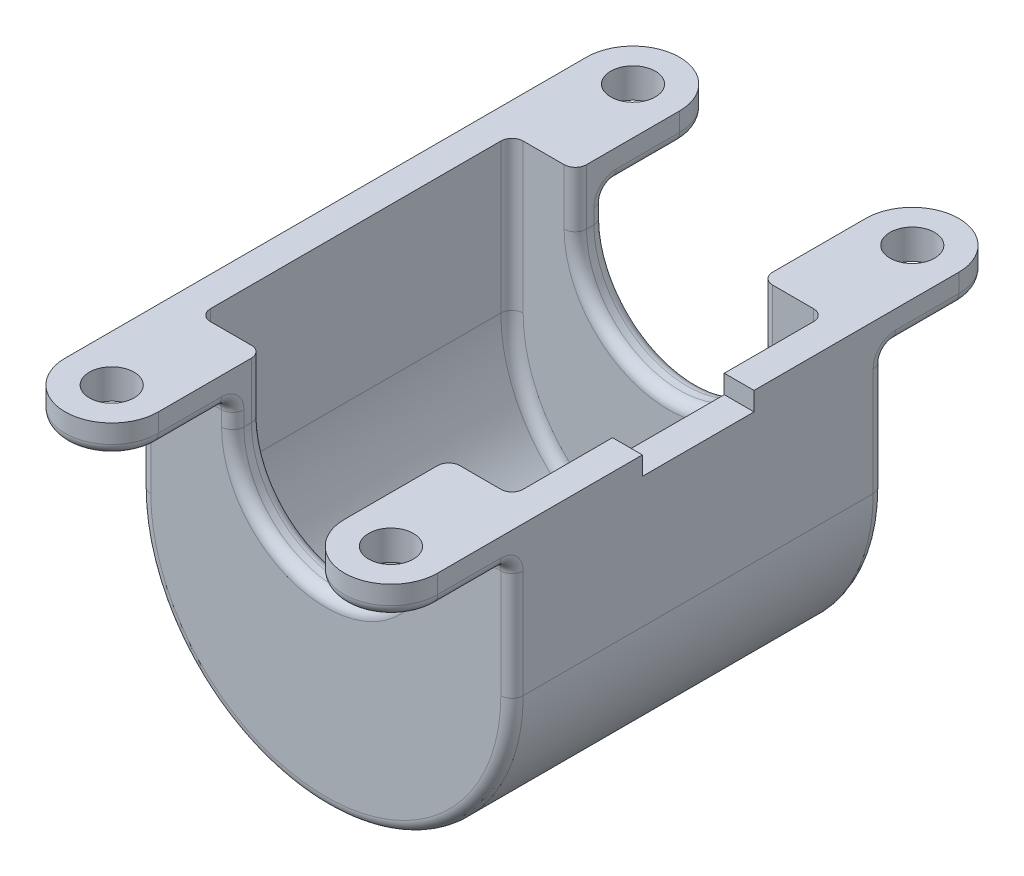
from build123d import *

# Parameters (mm, degrees)
BOSS_EXTRUDE1_DEPTH        = 50
SHELL1_T                   = -8
BOSS_EXTRUDE2_DEPTH        = 8
F_12_0_12_DIAMETER_HOLE1_D = 12
MIRROR2_COPY_1_DEPTH       = 8
MIRROR2_COPY_2_D           = 12
SKETCH6_W                  = 30
SKETCH6_H                  = 10
CUT_EXTRUDE1_DEPTH         = 123.193494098
FILLET1_R                  = 3
FILLET2_R                  = 3


with BuildPart() as part:
    # Sketch1 → Boss-Extrude1 (new, symmetric)
    with BuildSketch(Plane.XY):
        with BuildLine():
            Line((-25, 15), (-25, 0))
            ThreePointArc((-25, 0), (0, -25), (25, 0))
            Line((25, 0), (25, 15))
            Line((25, 15), (50, 15))
            Line((50, 15), (50, -25))
            ThreePointArc((50, -25), (0, -75), (-50, -25))
            Line((-50, -25), (-50, 15))
            Line((-50, 15), (-25, 15))
        make_face()
    extrude(amount=BOSS_EXTRUDE1_DEPTH, both=True)

    # Shell1
    shell1_openings = [part.faces().sort_by_distance(p)[0] for p in [
        (-25, 7.5, 0),
        (0, -25, 0),
        (25, 7.5, 0),
        (37.5, 15, 0),
        (-37.5, 15, 0),
    ]]
    offset(amount=SHELL1_T, openings=shell1_openings, kind=Kind.INTERSECTION)

    # Sketch2 → Boss-Extrude2 (add)
    with BuildSketch(Plane(origin=(0, 15, 0), x_dir=(1, 0, 0), z_dir=(0, 1, 0))):
        with BuildLine():
            Line((-50, -50), (-25, -50))
            Line((-25, -50), (-25, -70))
            ThreePointArc((-25, -70), (-37.5, -82.5), (-50, -70))
            Line((-50, -70), (-50, -50))
        make_face()
    boss_extrude2 = extrude(amount=-BOSS_EXTRUDE2_DEPTH)

    # 12.0 _12_ Diameter Hole1 (through all)
    with Locations(Plane(origin=(0, 15, 0), x_dir=(1, 0, 0), z_dir=(0, 1, 0))):
        with Locations((-37.5, -70)):
            f_12_0_12_diameter_hole1 = Hole(F_12_0_12_DIAMETER_HOLE1_D / 2)

    # Mirror1: Boss-Extrude2, 12.0 _12_ Diameter Hole1 across plane
    add(boss_extrude2.mirror(Plane(origin=(0, 0, 0), x_dir=(0, 0, 1), z_dir=(1, 0, 0))))
    add(f_12_0_12_diameter_hole1.mirror(Plane(origin=(0, 0, 0), x_dir=(0, 0, 1), z_dir=(1, 0, 0))), mode=Mode.SUBTRACT)

    # Mirror2: Boss-Extrude2, 12.0 _12_ Diameter Hole1 across plane
    add(boss_extrude2.mirror(Plane.XY))
    add(f_12_0_12_diameter_hole1.mirror(Plane.XY), mode=Mode.SUBTRACT)

    # Mirror2 copy 1 sketch → Mirror2 copy 1 (add)
    with BuildSketch(Plane(origin=(0, 15, 0), x_dir=(-1, 0, 0), z_dir=(0, 1, 0))):
        with BuildLine():
            Line((-50, -50), (-25, -50))
            Line((-25, -50), (-25, -70))
            ThreePointArc((-25, -70), (-37.5, -82.5), (-50, -70))
            Line((-50, -70), (-50, -50))
        make_face()
    extrude(amount=-MIRROR2_COPY_1_DEPTH)

    # Mirror2 copy 2 (through all)
    with Locations(Plane(origin=(0, 15, 0), x_dir=(-1, 0, 0), z_dir=(0, 1, 0))):
        with Locations((-37.5, -70)):
            Hole(MIRROR2_COPY_2_D / 2)

    # Sketch6 → Cut-Extrude1 (cut, through all)
    with BuildSketch(Plane(origin=(0, 0, 0), x_dir=(0, 0, -1), z_dir=(1, 0, 0))):
        with Locations((0, 15)):
            Rectangle(SKETCH6_W, SKETCH6_H)
    extrude(amount=CUT_EXTRUDE1_DEPTH, mode=Mode.SUBTRACT)

    # Fillet1
    fillet1_edges = [part.edges().sort_by_distance(p)[0] for p in [
        (-37.5, 7, -50),
        (37.5, 7, -50),
        (37.5, 7, 50),
        (-37.5, 7, 50),
    ]]
    fillet(fillet1_edges, radius=FILLET1_R)

    # Fillet2
    fillet2_edges = [part.edges().sort_by_distance(p)[0] for p in [
        (0, -75, 50),
        (-37.5, 7, -82.5),
        (-25, 7, -61.5),
        (50, -10.5, 50),
        (-50, 7, -61.5),
        (25, 2, -50),
        (-50, -10.5, -50),
        (50, 7, -61.5),
        (50, 7, 61.5),
        (25, 2, 50),
        (-50, -10.5, 50),
        (-50, 7, 61.5),
        (-50, 6.121320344, -50.878679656),
        (-25, 6.121320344, -50.878679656),
        (50, 6.121320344, -50.878679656),
        (25, 6.121320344, -50.878679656),
        (50, 6.121320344, 50.878679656),
        (25, 6.121320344, 50.878679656),
        (-50, 6.121320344, 50.878679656),
        (-25, 6.121320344, 50.878679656),
        (0, -25, 50),
        (-25, 2, 50),
        (-42, -5, -42),
        (0, -67, -42),
        (42, -5, -42),
        (25, 7.5, -42),
        (0, -25, -42),
        (-25, 7.5, -42),
        (-42, -5, 42),
        (0, -67, 42),
        (42, -5, 42),
        (25, 7.5, 42),
        (0, -25, 42),
        (-25, 7.5, 42),
        (-25, 7, 61.5),
        (-37.5, 7, 82.5),
        (37.5, 7, 82.5),
        (25, 7, 61.5),
        (-25, 2, -50),
        (0, -25, -50),
        (25, 7, -61.5),
        (37.5, 7, -82.5),
        (50, -10.5, -50),
        (0, -75, -50),
    ]]
    fillet(fillet2_edges, radius=FILLET2_R)


solid = part.part
